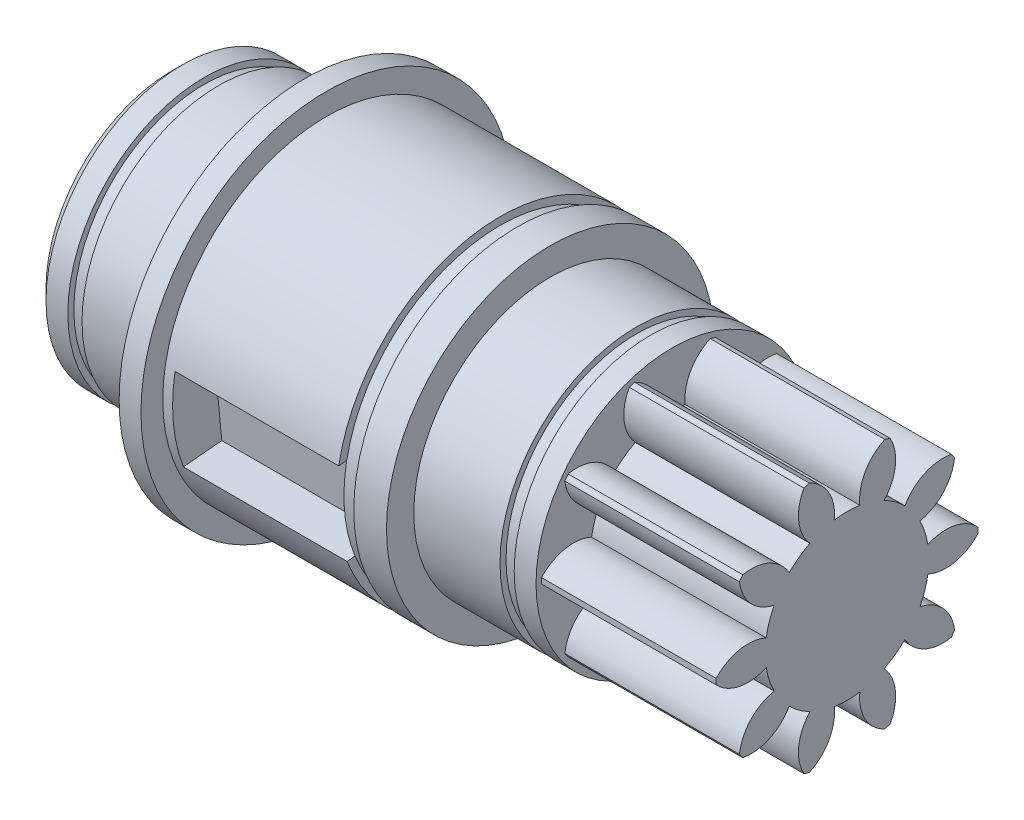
from build123d import *

# Parameters (mm, degrees)
BASPROSKE_W             = 16
BASPROSKE_H             = 12
TOOTHCUT_DEPTH          = 24.323807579
TEETHCUTS_COUNT         = 10
TEETHCUTS_ANGLE         = 324
BORSKE_R                = 7.4736
BORE_DEPTH              = 50.0000508
EXTRUSION2_START        = -16
ESQUISSE1_R             = 7.499
EXTRUSION2_DEPTH        = 16
ESQUISSE2_R             = 12.5
EXTRUSION3_DEPTH        = 2
ESQUISSE3_R             = 11.95
EXTRUSION4_DEPTH        = 1.3
ESQUISSE4_R             = 12.5
EXTRUSION5_DEPTH        = 7.9
ESQUISSE5_R             = 15
EXTRUSION6_DEPTH        = 3
ESQUISSE6_R             = 14.3
EXTRUSION7_DEPTH        = 1.6
ESQUISSE7_R             = 15
EXTRUSION8_DEPTH        = 15.9
ESQUISSE8_R             = 17
EXTRUSION9_DEPTH        = 2
ESQUISSE9_R             = 12.5
EXTRUSION11_DEPTH       = 7.9
ESQUISSE10_R            = 11.95
EXTRUSION12_DEPTH       = 1.3
ESQUISSE11_R            = 12.5
EXTRUSION13_DEPTH       = 3
CHANFREIN1_SIZE         = 1
ENL_V_MAT_EXTRU_1_DEPTH = 15


with BuildPart() as part:
    # BasProSke → Base-Revolve (revolve)
    with BuildSketch(Plane(origin=(0, 0, 0), x_dir=(1, 0, 0), z_dir=(0, 1, 0)), mode=Mode.PRIVATE) as base_revolve_sk:
        with Locations((8, 6)):
            Rectangle(BASPROSKE_W, BASPROSKE_H)
    revolve(base_revolve_sk.sketch.rotate(Axis((-10, 0, 0), (1, 0, 0)), 180), axis=Axis((-10, 0, 0), (1, 0, 0)))

    # TooCutSke → ToothCut (cut, through all)
    with BuildSketch(Plane(origin=(0, 0, 0), x_dir=(0, 0, -1), z_dir=(1, 0, 0))):
        with BuildLine():
            ThreePointArc((1.173662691, 7.406586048), (0, 7.499), (-1.173662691, 7.406586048))
            ThreePointArc((-1.173662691, 7.406586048), (-1.668191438, 9.834565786), (-3.497907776, 11.50542856))
            ThreePointArc((-3.497907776, 11.50542856), (0, 12.0254), (3.497907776, 11.50542856))
            ThreePointArc((3.497907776, 11.50542856), (1.668191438, 9.834565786), (1.173662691, 7.406586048))
        make_face()
    toothcut = extrude(amount=TOOTHCUT_DEPTH, mode=Mode.SUBTRACT)

    # TeethCuts: ToothCut ×10 about axis
    teethcuts_axis = Axis((-10, 0, 0), (1, 0, 0))
    for i in range(1, TEETHCUTS_COUNT):
        add(toothcut.rotate(teethcuts_axis, i * TEETHCUTS_ANGLE / (TEETHCUTS_COUNT - 1)), mode=Mode.SUBTRACT)

    # BorSke → Bore (cut, symmetric)
    with BuildSketch(Plane(origin=(0, 0, 0), x_dir=(0, 0, -1), z_dir=(1, 0, 0))):
        with Locations(Location((0, 0, 0), (0, 0, 180))):
            Circle(BORSKE_R)
    extrude(amount=BORE_DEPTH, both=True, mode=Mode.SUBTRACT)

    # Esquisse1 → Extrusion2 (add)
    with BuildSketch(Plane(origin=(16, 0, 0), x_dir=(0, 0, -1), z_dir=(1, 0, 0)).offset(EXTRUSION2_START)):
        Circle(ESQUISSE1_R)
    extrude(amount=EXTRUSION2_DEPTH)

    # Esquisse2 → Extrusion3 (add)
    with BuildSketch(Plane.ZY):
        Circle(ESQUISSE2_R)
    extrude(amount=EXTRUSION3_DEPTH)

    # Esquisse3 → Extrusion4 (add)
    with BuildSketch(Plane.ZY.offset(2)):
        Circle(ESQUISSE3_R)
    extrude(amount=EXTRUSION4_DEPTH)

    # Esquisse4 → Extrusion5 (add)
    with BuildSketch(Plane.ZY.offset(3.3)):
        Circle(ESQUISSE4_R)
    extrude(amount=EXTRUSION5_DEPTH)

    # Esquisse5 → Extrusion6 (add)
    with BuildSketch(Plane.ZY.offset(11.2)):
        Circle(ESQUISSE5_R)
    extrude(amount=EXTRUSION6_DEPTH)

    # Esquisse6 → Extrusion7 (add)
    with BuildSketch(Plane.ZY.offset(14.2)):
        Circle(ESQUISSE6_R)
    extrude(amount=EXTRUSION7_DEPTH)

    # Esquisse7 → Extrusion8 (add)
    with BuildSketch(Plane.ZY.offset(15.8)):
        Circle(ESQUISSE7_R)
    extrude(amount=EXTRUSION8_DEPTH)

    # Esquisse8 → Extrusion9 (add)
    with BuildSketch(Plane.ZY.offset(31.7)):
        Circle(ESQUISSE8_R)
    extrude(amount=EXTRUSION9_DEPTH)

    # Esquisse9 → Extrusion11 (add)
    with BuildSketch(Plane.ZY.offset(33.7)):
        Circle(ESQUISSE9_R)
    extrude(amount=EXTRUSION11_DEPTH)

    # Esquisse10 → Extrusion12 (add)
    with BuildSketch(Plane.ZY.offset(41.6)):
        Circle(ESQUISSE10_R)
    extrude(amount=EXTRUSION12_DEPTH)

    # Esquisse11 → Extrusion13 (add)
    with BuildSketch(Plane.ZY.offset(42.9)):
        Circle(ESQUISSE11_R)
    extrude(amount=EXTRUSION13_DEPTH)

    # Chanfrein1
    chanfrein1_edges = [part.edges().sort_by_distance(p)[0] for p in [
        (-45.9, 0, -12.5),
    ]]
    chamfer(chanfrein1_edges, length=CHANFREIN1_SIZE)

    # Esquisse12 → Enl_v. mat.-Extru.1 (cut)
    with BuildSketch(Plane(origin=(-15.8, 0, 0), x_dir=(0, 0, -1), z_dir=(1, 0, 0))):
        Polygon((-18.25652511, 2.268725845), (-17.493347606, -5.69478846), (-10.493347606, -5.023948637), (-11.25652511, 2.939565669), align=None)
    extrude(amount=-ENL_V_MAT_EXTRU_1_DEPTH, mode=Mode.SUBTRACT)


solid = part.part
